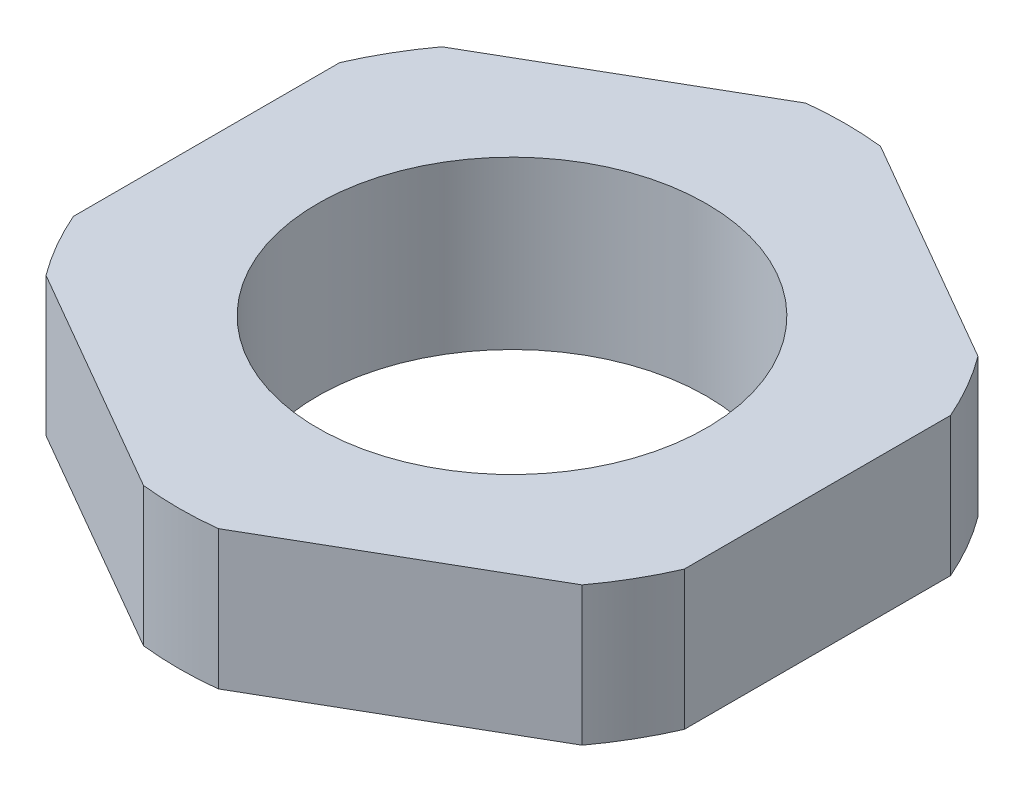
ISO-10303-21;
HEADER;
FILE_DESCRIPTION(('STEP AP214'),'2;1');
FILE_NAME('part.step','',(''),(''),'','','');
FILE_SCHEMA(('AUTOMOTIVE_DESIGN { 1 0 10303 214 1 1 1 1 }'));
ENDSEC;
DATA;
#1=APPLICATION_CONTEXT('core data for automotive mechanical design processes');
#2=APPLICATION_PROTOCOL_DEFINITION('international standard','automotive_design',2000,#1);
#3=PRODUCT_CONTEXT('',#1,'mechanical');
#4=PRODUCT('Part','Part','',(#3));
#5=PRODUCT_RELATED_PRODUCT_CATEGORY('part','',(#4));
#6=PRODUCT_DEFINITION_FORMATION('','',#4);
#7=PRODUCT_DEFINITION_CONTEXT('part definition',#1,'design');
#8=PRODUCT_DEFINITION('design','',#6,#7);
#9=PRODUCT_DEFINITION_SHAPE('','',#8);
#10=(LENGTH_UNIT() NAMED_UNIT(*) SI_UNIT(.MILLI.,.METRE.));
#11=(NAMED_UNIT(*) PLANE_ANGLE_UNIT() SI_UNIT($,.RADIAN.));
#12=(NAMED_UNIT(*) SI_UNIT($,.STERADIAN.) SOLID_ANGLE_UNIT());
#13=UNCERTAINTY_MEASURE_WITH_UNIT(LENGTH_MEASURE(1.E-05),#10,'distance_accuracy_value','');
#14=(GEOMETRIC_REPRESENTATION_CONTEXT(3) GLOBAL_UNCERTAINTY_ASSIGNED_CONTEXT((#13)) GLOBAL_UNIT_ASSIGNED_CONTEXT((#10,
#11,#12)) REPRESENTATION_CONTEXT('',''));
#15=CARTESIAN_POINT('',(0.,0.,0.));
#16=DIRECTION('',(0.,0.,1.));
#17=DIRECTION('',(1.,0.,0.));
#18=AXIS2_PLACEMENT_3D('',#15,#16,#17);
#19=CARTESIAN_POINT('',(0.,1.00000000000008,0.));
#20=DIRECTION('',(0.,1.,0.));
#21=DIRECTION('',(0.,0.,1.));
#22=AXIS2_PLACEMENT_3D('',#19,#20,#21);
#23=CONICAL_SURFACE('',#22,10.4999999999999,0.7853981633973);
#24=CARTESIAN_POINT('',(0.,0.,0.));
#25=DIRECTION('',(0.,1.,0.));
#26=DIRECTION('',(0.,0.,1.));
#27=AXIS2_PLACEMENT_3D('',#24,#25,#26);
#28=CIRCLE('',#27,9.50000000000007);
#29=CARTESIAN_POINT('',(0.,0.,9.50000000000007));
#30=VERTEX_POINT('',#29);
#31=EDGE_CURVE('P0_E122',#30,#30,#28,.F.);
#32=ORIENTED_EDGE('',*,*,#31,.F.);
#33=EDGE_LOOP('',(#32));
#34=FACE_BOUND('',#33,.T.);
#35=CARTESIAN_POINT('',(0.,1.00000000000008,0.));
#36=DIRECTION('',(0.,1.,0.));
#37=DIRECTION('',(0.,0.,1.));
#38=AXIS2_PLACEMENT_3D('',#35,#36,#37);
#39=CIRCLE('',#38,10.4999999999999);
#40=CARTESIAN_POINT('',(0.,1.00000000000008,10.4999999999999));
#41=VERTEX_POINT('',#40);
#42=EDGE_CURVE('P0_E19',#41,#41,#39,.T.);
#43=ORIENTED_EDGE('',*,*,#42,.F.);
#44=EDGE_LOOP('',(#43));
#45=FACE_BOUND('',#44,.T.);
#46=ADVANCED_FACE('P0_F16',(#34,#45),#23,.T.);
#47=CARTESIAN_POINT('',(0.,1.,0.));
#48=DIRECTION('',(0.,-1.,0.));
#49=DIRECTION('',(0.,0.,-1.));
#50=AXIS2_PLACEMENT_3D('',#47,#48,#49);
#51=PLANE('',#50);
#52=ORIENTED_EDGE('',*,*,#42,.T.);
#53=EDGE_LOOP('',(#52));
#54=FACE_BOUND('',#53,.T.);
#55=CARTESIAN_POINT('',(0.,1.,0.));
#56=DIRECTION('',(0.,-1.,0.));
#57=DIRECTION('',(0.,0.,-1.));
#58=AXIS2_PLACEMENT_3D('',#55,#56,#57);
#59=CIRCLE('',#58,12.);
#60=CARTESIAN_POINT('',(1.34668806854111,1.,-11.9241952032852));
#61=VERTEX_POINT('',#60);
#62=CARTESIAN_POINT('',(-1.34668806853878,1.,-11.9241952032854));
#63=VERTEX_POINT('',#62);
#64=EDGE_CURVE('P0_E118',#61,#63,#59,.F.);
#65=ORIENTED_EDGE('',*,*,#64,.F.);
#66=DIRECTION('',(0.866025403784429,0.,0.500000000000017));
#67=VECTOR('',#66,1.);
#68=CARTESIAN_POINT('',(11.,1.,-6.350852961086));
#69=LINE('',#68,#67);
#70=CARTESIAN_POINT('',(9.65331193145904,1.,-7.12836367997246));
#71=VERTEX_POINT('',#70);
#72=EDGE_CURVE('P0_E113',#61,#71,#69,.T.);
#73=ORIENTED_EDGE('',*,*,#72,.T.);
#74=CARTESIAN_POINT('',(0.,1.,0.));
#75=DIRECTION('',(0.,-1.,0.));
#76=DIRECTION('',(0.,0.,-1.));
#77=AXIS2_PLACEMENT_3D('',#74,#75,#76);
#78=CIRCLE('',#77,12.);
#79=CARTESIAN_POINT('',(11.,1.,-4.79583152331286));
#80=VERTEX_POINT('',#79);
#81=EDGE_CURVE('P0_E103',#80,#71,#78,.F.);
#82=ORIENTED_EDGE('',*,*,#81,.F.);
#83=DIRECTION('',(0.,0.,1.));
#84=VECTOR('',#83,1.);
#85=CARTESIAN_POINT('',(11.,1.,6.350852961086));
#86=LINE('',#85,#84);
#87=CARTESIAN_POINT('',(10.9999999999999,1.,4.79583152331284));
#88=VERTEX_POINT('',#87);
#89=EDGE_CURVE('P0_E128',#80,#88,#86,.T.);
#90=ORIENTED_EDGE('',*,*,#89,.T.);
#91=CARTESIAN_POINT('',(0.,1.,0.));
#92=DIRECTION('',(0.,-1.,0.));
#93=DIRECTION('',(0.,0.,-1.));
#94=AXIS2_PLACEMENT_3D('',#91,#92,#93);
#95=CIRCLE('',#94,12.);
#96=CARTESIAN_POINT('',(9.65331193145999,1.,7.1283636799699));
#97=VERTEX_POINT('',#96);
#98=EDGE_CURVE('P0_E150',#97,#88,#95,.F.);
#99=ORIENTED_EDGE('',*,*,#98,.F.);
#100=DIRECTION('',(-0.866025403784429,0.,0.500000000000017));
#101=VECTOR('',#100,1.);
#102=CARTESIAN_POINT('',(0.,1.,12.70170592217));
#103=LINE('',#102,#101);
#104=CARTESIAN_POINT('',(1.34668806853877,1.,11.9241952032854));
#105=VERTEX_POINT('',#104);
#106=EDGE_CURVE('P0_E145',#97,#105,#103,.T.);
#107=ORIENTED_EDGE('',*,*,#106,.T.);
#108=CARTESIAN_POINT('',(0.,1.,0.));
#109=DIRECTION('',(0.,-1.,0.));
#110=DIRECTION('',(0.,0.,-1.));
#111=AXIS2_PLACEMENT_3D('',#108,#109,#110);
#112=CIRCLE('',#111,12.);
#113=CARTESIAN_POINT('',(-1.34668806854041,1.,11.9241952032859));
#114=VERTEX_POINT('',#113);
#115=EDGE_CURVE('P0_E148',#114,#105,#112,.F.);
#116=ORIENTED_EDGE('',*,*,#115,.F.);
#117=DIRECTION('',(-0.866025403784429,0.,-0.500000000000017));
#118=VECTOR('',#117,1.);
#119=CARTESIAN_POINT('',(-11.,1.,6.350852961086));
#120=LINE('',#119,#118);
#121=CARTESIAN_POINT('',(-9.65331193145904,1.,7.12836367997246));
#122=VERTEX_POINT('',#121);
#123=EDGE_CURVE('P0_E140',#114,#122,#120,.T.);
#124=ORIENTED_EDGE('',*,*,#123,.T.);
#125=CARTESIAN_POINT('',(0.,1.,0.));
#126=DIRECTION('',(0.,-1.,0.));
#127=DIRECTION('',(0.,0.,-1.));
#128=AXIS2_PLACEMENT_3D('',#125,#126,#127);
#129=CIRCLE('',#128,12.);
#130=CARTESIAN_POINT('',(-11.,1.,4.79583152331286));
#131=VERTEX_POINT('',#130);
#132=EDGE_CURVE('P0_E143',#131,#122,#129,.F.);
#133=ORIENTED_EDGE('',*,*,#132,.F.);
#134=DIRECTION('',(0.,0.,-1.));
#135=VECTOR('',#134,1.);
#136=CARTESIAN_POINT('',(-11.,1.,-6.350852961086));
#137=LINE('',#136,#135);
#138=CARTESIAN_POINT('',(-10.9999999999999,1.,-4.79583152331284));
#139=VERTEX_POINT('',#138);
#140=EDGE_CURVE('P0_E135',#131,#139,#137,.T.);
#141=ORIENTED_EDGE('',*,*,#140,.T.);
#142=CARTESIAN_POINT('',(0.,1.,0.));
#143=DIRECTION('',(0.,-1.,0.));
#144=DIRECTION('',(0.,0.,-1.));
#145=AXIS2_PLACEMENT_3D('',#142,#143,#144);
#146=CIRCLE('',#145,12.);
#147=CARTESIAN_POINT('',(-9.65331193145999,1.,-7.1283636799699));
#148=VERTEX_POINT('',#147);
#149=EDGE_CURVE('P0_E138',#148,#139,#146,.F.);
#150=ORIENTED_EDGE('',*,*,#149,.F.);
#151=DIRECTION('',(0.866025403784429,0.,-0.500000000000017));
#152=VECTOR('',#151,1.);
#153=CARTESIAN_POINT('',(0.,1.,-12.70170592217));
#154=LINE('',#153,#152);
#155=EDGE_CURVE('P0_E132',#148,#63,#154,.T.);
#156=ORIENTED_EDGE('',*,*,#155,.T.);
#157=EDGE_LOOP('',(#65,#73,#82,#90,#99,#107,#116,#124,#133,#141,#150,#156));
#158=FACE_BOUND('',#157,.T.);
#159=ADVANCED_FACE('P0_F116',(#54,#158),#51,.T.);
#160=CARTESIAN_POINT('',(0.,0.,0.));
#161=DIRECTION('',(0.,-1.,0.));
#162=DIRECTION('',(0.,0.,-1.));
#163=AXIS2_PLACEMENT_3D('',#160,#161,#162);
#164=PLANE('',#163);
#165=CARTESIAN_POINT('',(0.,0.,0.));
#166=DIRECTION('',(0.,-1.,0.));
#167=DIRECTION('',(0.,0.,-1.));
#168=AXIS2_PLACEMENT_3D('',#165,#166,#167);
#169=CIRCLE('',#168,7.);
#170=CARTESIAN_POINT('',(0.,0.,-7.));
#171=VERTEX_POINT('',#170);
#172=EDGE_CURVE('P0_E172',#171,#171,#169,.F.);
#173=ORIENTED_EDGE('',*,*,#172,.T.);
#174=EDGE_LOOP('',(#173));
#175=FACE_BOUND('',#174,.T.);
#176=ORIENTED_EDGE('',*,*,#31,.T.);
#177=EDGE_LOOP('',(#176));
#178=FACE_BOUND('',#177,.T.);
#179=ADVANCED_FACE('P0_F197',(#175,#178),#164,.T.);
#180=CARTESIAN_POINT('',(11.,0.,-6.350852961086));
#181=DIRECTION('',(-0.500000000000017,0.,0.866025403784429));
#182=DIRECTION('',(0.866025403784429,0.,0.500000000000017));
#183=AXIS2_PLACEMENT_3D('',#180,#181,#182);
#184=PLANE('',#183);
#185=ORIENTED_EDGE('',*,*,#72,.F.);
#186=DIRECTION('',(0.,-1.,0.));
#187=VECTOR('',#186,1.);
#188=CARTESIAN_POINT('',(1.34668806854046,6.3,-11.9241952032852));
#189=LINE('',#188,#187);
#190=CARTESIAN_POINT('',(1.34668806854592,6.,-11.9241952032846));
#191=VERTEX_POINT('',#190);
#192=EDGE_CURVE('P0_E175',#191,#61,#189,.T.);
#193=ORIENTED_EDGE('',*,*,#192,.F.);
#194=DIRECTION('',(0.866025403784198,0.,0.500000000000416));
#195=VECTOR('',#194,1.);
#196=CARTESIAN_POINT('',(1.346688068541,6.,-11.92419520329));
#197=LINE('',#196,#195);
#198=CARTESIAN_POINT('',(9.65331193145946,6.,-7.1283636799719));
#199=VERTEX_POINT('',#198);
#200=EDGE_CURVE('P0_E126',#191,#199,#197,.T.);
#201=ORIENTED_EDGE('',*,*,#200,.T.);
#202=DIRECTION('',(0.,-1.,0.));
#203=VECTOR('',#202,1.);
#204=CARTESIAN_POINT('',(9.65331193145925,6.3,-7.12836367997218));
#205=LINE('',#204,#203);
#206=EDGE_CURVE('P0_E110',#71,#199,#205,.F.);
#207=ORIENTED_EDGE('',*,*,#206,.F.);
#208=EDGE_LOOP('',(#185,#193,#201,#207));
#209=FACE_BOUND('',#208,.T.);
#210=ADVANCED_FACE('P0_F125',(#209),#184,.F.);
#211=CARTESIAN_POINT('',(0.,6.3,0.));
#212=DIRECTION('',(0.,-1.,0.));
#213=DIRECTION('',(0.,0.,-1.));
#214=AXIS2_PLACEMENT_3D('',#211,#212,#213);
#215=CYLINDRICAL_SURFACE('',#214,12.);
#216=ORIENTED_EDGE('',*,*,#81,.T.);
#217=ORIENTED_EDGE('',*,*,#206,.T.);
#218=CARTESIAN_POINT('',(0.,6.,0.));
#219=DIRECTION('',(0.,-1.,0.));
#220=DIRECTION('',(0.,0.,-1.));
#221=AXIS2_PLACEMENT_3D('',#218,#219,#220);
#222=CIRCLE('',#221,12.);
#223=CARTESIAN_POINT('',(11.,6.,-4.79583152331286));
#224=VERTEX_POINT('',#223);
#225=EDGE_CURVE('P0_E170',#199,#224,#222,.T.);
#226=ORIENTED_EDGE('',*,*,#225,.T.);
#227=DIRECTION('',(0.,1.,0.));
#228=VECTOR('',#227,1.);
#229=CARTESIAN_POINT('',(11.,0.,-4.795831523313));
#230=LINE('',#229,#228);
#231=EDGE_CURVE('P0_E112',#224,#80,#230,.F.);
#232=ORIENTED_EDGE('',*,*,#231,.T.);
#233=EDGE_LOOP('',(#216,#217,#226,#232));
#234=FACE_BOUND('',#233,.T.);
#235=ADVANCED_FACE('P0_F107',(#234),#215,.T.);
#236=CARTESIAN_POINT('',(11.,0.,6.350852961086));
#237=DIRECTION('',(-1.,0.,0.));
#238=DIRECTION('',(0.,0.,1.));
#239=AXIS2_PLACEMENT_3D('',#236,#237,#238);
#240=PLANE('',#239);
#241=ORIENTED_EDGE('',*,*,#231,.F.);
#242=DIRECTION('',(0.,0.,-1.));
#243=VECTOR('',#242,1.);
#244=CARTESIAN_POINT('',(11.,6.,0.));
#245=LINE('',#244,#243);
#246=CARTESIAN_POINT('',(10.9999999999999,6.,4.79583152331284));
#247=VERTEX_POINT('',#246);
#248=EDGE_CURVE('P0_E169',#224,#247,#245,.F.);
#249=ORIENTED_EDGE('',*,*,#248,.T.);
#250=DIRECTION('',(0.,-1.,0.));
#251=VECTOR('',#250,1.);
#252=CARTESIAN_POINT('',(10.9999999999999,6.3,4.79583152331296));
#253=LINE('',#252,#251);
#254=EDGE_CURVE('P0_E183',#88,#247,#253,.F.);
#255=ORIENTED_EDGE('',*,*,#254,.F.);
#256=ORIENTED_EDGE('',*,*,#89,.F.);
#257=EDGE_LOOP('',(#241,#249,#255,#256));
#258=FACE_BOUND('',#257,.T.);
#259=ADVANCED_FACE('P0_F245',(#258),#240,.F.);
#260=CARTESIAN_POINT('',(0.,6.3,0.));
#261=DIRECTION('',(0.,-1.,0.));
#262=DIRECTION('',(0.,0.,-1.));
#263=AXIS2_PLACEMENT_3D('',#260,#261,#262);
#264=CYLINDRICAL_SURFACE('',#263,12.);
#265=CARTESIAN_POINT('',(0.,6.,0.));
#266=DIRECTION('',(0.,-1.,0.));
#267=DIRECTION('',(0.,0.,-1.));
#268=AXIS2_PLACEMENT_3D('',#265,#266,#267);
#269=CIRCLE('',#268,12.);
#270=CARTESIAN_POINT('',(9.653311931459,6.,7.12836367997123));
#271=VERTEX_POINT('',#270);
#272=EDGE_CURVE('P0_E166',#247,#271,#269,.T.);
#273=ORIENTED_EDGE('',*,*,#272,.T.);
#274=DIRECTION('',(0.,1.,0.));
#275=VECTOR('',#274,1.);
#276=CARTESIAN_POINT('',(9.65331193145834,0.,7.12836367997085));
#277=LINE('',#276,#275);
#278=EDGE_CURVE('P0_E149',#271,#97,#277,.F.);
#279=ORIENTED_EDGE('',*,*,#278,.T.);
#280=ORIENTED_EDGE('',*,*,#98,.T.);
#281=ORIENTED_EDGE('',*,*,#254,.T.);
#282=EDGE_LOOP('',(#273,#279,#280,#281));
#283=FACE_BOUND('',#282,.T.);
#284=ADVANCED_FACE('P0_F241',(#283),#264,.T.);
#285=CARTESIAN_POINT('',(0.,0.,12.70170592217));
#286=DIRECTION('',(-0.500000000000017,0.,-0.866025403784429));
#287=DIRECTION('',(-0.866025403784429,0.,0.500000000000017));
#288=AXIS2_PLACEMENT_3D('',#285,#286,#287);
#289=PLANE('',#288);
#290=DIRECTION('',(0.,-1.,0.));
#291=VECTOR('',#290,1.);
#292=CARTESIAN_POINT('',(1.34668806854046,6.3,11.9241952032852));
#293=LINE('',#292,#291);
#294=CARTESIAN_POINT('',(1.34668806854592,6.,11.9241952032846));
#295=VERTEX_POINT('',#294);
#296=EDGE_CURVE('P0_E182',#105,#295,#293,.F.);
#297=ORIENTED_EDGE('',*,*,#296,.F.);
#298=ORIENTED_EDGE('',*,*,#106,.F.);
#299=ORIENTED_EDGE('',*,*,#278,.F.);
#300=DIRECTION('',(-0.866025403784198,0.,0.500000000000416));
#301=VECTOR('',#300,1.);
#302=CARTESIAN_POINT('',(9.653311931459,6.,7.128363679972));
#303=LINE('',#302,#301);
#304=EDGE_CURVE('P0_E165',#271,#295,#303,.T.);
#305=ORIENTED_EDGE('',*,*,#304,.T.);
#306=EDGE_LOOP('',(#297,#298,#299,#305));
#307=FACE_BOUND('',#306,.T.);
#308=ADVANCED_FACE('P0_F237',(#307),#289,.F.);
#309=CARTESIAN_POINT('',(0.,6.3,0.));
#310=DIRECTION('',(0.,-1.,0.));
#311=DIRECTION('',(0.,0.,-1.));
#312=AXIS2_PLACEMENT_3D('',#309,#310,#311);
#313=CYLINDRICAL_SURFACE('',#312,12.);
#314=CARTESIAN_POINT('',(0.,6.,0.));
#315=DIRECTION('',(0.,-1.,0.));
#316=DIRECTION('',(0.,0.,-1.));
#317=AXIS2_PLACEMENT_3D('',#314,#315,#316);
#318=CIRCLE('',#317,12.);
#319=CARTESIAN_POINT('',(-1.34668806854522,6.,11.9241952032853));
#320=VERTEX_POINT('',#319);
#321=EDGE_CURVE('P0_E162',#295,#320,#318,.T.);
#322=ORIENTED_EDGE('',*,*,#321,.T.);
#323=DIRECTION('',(0.,1.,0.));
#324=VECTOR('',#323,1.);
#325=CARTESIAN_POINT('',(-1.34668806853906,0.,11.9241952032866));
#326=LINE('',#325,#324);
#327=EDGE_CURVE('P0_E144',#320,#114,#326,.F.);
#328=ORIENTED_EDGE('',*,*,#327,.T.);
#329=ORIENTED_EDGE('',*,*,#115,.T.);
#330=ORIENTED_EDGE('',*,*,#296,.T.);
#331=EDGE_LOOP('',(#322,#328,#329,#330));
#332=FACE_BOUND('',#331,.T.);
#333=ADVANCED_FACE('P0_F233',(#332),#313,.T.);
#334=CARTESIAN_POINT('',(-11.,0.,6.350852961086));
#335=DIRECTION('',(0.500000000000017,0.,-0.866025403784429));
#336=DIRECTION('',(-0.866025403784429,0.,-0.500000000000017));
#337=AXIS2_PLACEMENT_3D('',#334,#335,#336);
#338=PLANE('',#337);
#339=DIRECTION('',(0.,-1.,0.));
#340=VECTOR('',#339,1.);
#341=CARTESIAN_POINT('',(-9.65331193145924,6.3,7.12836367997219));
#342=LINE('',#341,#340);
#343=CARTESIAN_POINT('',(-9.65331193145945,6.,7.1283636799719));
#344=VERTEX_POINT('',#343);
#345=EDGE_CURVE('P0_E180',#122,#344,#342,.F.);
#346=ORIENTED_EDGE('',*,*,#345,.F.);
#347=ORIENTED_EDGE('',*,*,#123,.F.);
#348=ORIENTED_EDGE('',*,*,#327,.F.);
#349=DIRECTION('',(-0.866025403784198,0.,-0.500000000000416));
#350=VECTOR('',#349,1.);
#351=CARTESIAN_POINT('',(-1.346688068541,6.,11.92419520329));
#352=LINE('',#351,#350);
#353=EDGE_CURVE('P0_E161',#320,#344,#352,.T.);
#354=ORIENTED_EDGE('',*,*,#353,.T.);
#355=EDGE_LOOP('',(#346,#347,#348,#354));
#356=FACE_BOUND('',#355,.T.);
#357=ADVANCED_FACE('P0_F229',(#356),#338,.F.);
#358=CARTESIAN_POINT('',(0.,6.3,0.));
#359=DIRECTION('',(0.,-1.,0.));
#360=DIRECTION('',(0.,0.,-1.));
#361=AXIS2_PLACEMENT_3D('',#358,#359,#360);
#362=CYLINDRICAL_SURFACE('',#361,12.);
#363=CARTESIAN_POINT('',(0.,6.,0.));
#364=DIRECTION('',(0.,-1.,0.));
#365=DIRECTION('',(0.,0.,-1.));
#366=AXIS2_PLACEMENT_3D('',#363,#364,#365);
#367=CIRCLE('',#366,12.);
#368=CARTESIAN_POINT('',(-11.,6.,4.79583152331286));
#369=VERTEX_POINT('',#368);
#370=EDGE_CURVE('P0_E158',#344,#369,#367,.T.);
#371=ORIENTED_EDGE('',*,*,#370,.T.);
#372=DIRECTION('',(0.,1.,0.));
#373=VECTOR('',#372,1.);
#374=CARTESIAN_POINT('',(-11.,0.,4.795831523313));
#375=LINE('',#374,#373);
#376=EDGE_CURVE('P0_E139',#369,#131,#375,.F.);
#377=ORIENTED_EDGE('',*,*,#376,.T.);
#378=ORIENTED_EDGE('',*,*,#132,.T.);
#379=ORIENTED_EDGE('',*,*,#345,.T.);
#380=EDGE_LOOP('',(#371,#377,#378,#379));
#381=FACE_BOUND('',#380,.T.);
#382=ADVANCED_FACE('P0_F225',(#381),#362,.T.);
#383=CARTESIAN_POINT('',(-11.,0.,-6.350852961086));
#384=DIRECTION('',(1.,0.,0.));
#385=DIRECTION('',(0.,0.,-1.));
#386=AXIS2_PLACEMENT_3D('',#383,#384,#385);
#387=PLANE('',#386);
#388=DIRECTION('',(0.,-1.,0.));
#389=VECTOR('',#388,1.);
#390=CARTESIAN_POINT('',(-10.9999999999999,6.3,-4.79583152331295));
#391=LINE('',#390,#389);
#392=CARTESIAN_POINT('',(-10.9999999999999,6.,-4.79583152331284));
#393=VERTEX_POINT('',#392);
#394=EDGE_CURVE('P0_E178',#139,#393,#391,.F.);
#395=ORIENTED_EDGE('',*,*,#394,.F.);
#396=ORIENTED_EDGE('',*,*,#140,.F.);
#397=ORIENTED_EDGE('',*,*,#376,.F.);
#398=DIRECTION('',(0.,0.,-1.));
#399=VECTOR('',#398,1.);
#400=CARTESIAN_POINT('',(-11.,6.,0.));
#401=LINE('',#400,#399);
#402=EDGE_CURVE('P0_E157',#369,#393,#401,.T.);
#403=ORIENTED_EDGE('',*,*,#402,.T.);
#404=EDGE_LOOP('',(#395,#396,#397,#403));
#405=FACE_BOUND('',#404,.T.);
#406=ADVANCED_FACE('P0_F221',(#405),#387,.F.);
#407=CARTESIAN_POINT('',(0.,6.3,0.));
#408=DIRECTION('',(0.,-1.,0.));
#409=DIRECTION('',(0.,0.,-1.));
#410=AXIS2_PLACEMENT_3D('',#407,#408,#409);
#411=CYLINDRICAL_SURFACE('',#410,12.);
#412=CARTESIAN_POINT('',(0.,6.,0.));
#413=DIRECTION('',(0.,-1.,0.));
#414=DIRECTION('',(0.,0.,-1.));
#415=AXIS2_PLACEMENT_3D('',#412,#413,#414);
#416=CIRCLE('',#415,12.);
#417=CARTESIAN_POINT('',(-9.653311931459,6.,-7.12836367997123));
#418=VERTEX_POINT('',#417);
#419=EDGE_CURVE('P0_E154',#393,#418,#416,.T.);
#420=ORIENTED_EDGE('',*,*,#419,.T.);
#421=DIRECTION('',(0.,1.,0.));
#422=VECTOR('',#421,1.);
#423=CARTESIAN_POINT('',(-9.65331193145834,0.,-7.12836367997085));
#424=LINE('',#423,#422);
#425=EDGE_CURVE('P0_E134',#418,#148,#424,.F.);
#426=ORIENTED_EDGE('',*,*,#425,.T.);
#427=ORIENTED_EDGE('',*,*,#149,.T.);
#428=ORIENTED_EDGE('',*,*,#394,.T.);
#429=EDGE_LOOP('',(#420,#426,#427,#428));
#430=FACE_BOUND('',#429,.T.);
#431=ADVANCED_FACE('P0_F217',(#430),#411,.T.);
#432=CARTESIAN_POINT('',(0.,0.,-12.70170592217));
#433=DIRECTION('',(0.500000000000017,0.,0.866025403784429));
#434=DIRECTION('',(0.866025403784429,0.,-0.500000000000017));
#435=AXIS2_PLACEMENT_3D('',#432,#433,#434);
#436=PLANE('',#435);
#437=ORIENTED_EDGE('',*,*,#155,.F.);
#438=ORIENTED_EDGE('',*,*,#425,.F.);
#439=DIRECTION('',(0.866025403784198,0.,-0.500000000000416));
#440=VECTOR('',#439,1.);
#441=CARTESIAN_POINT('',(-9.653311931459,6.,-7.128363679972));
#442=LINE('',#441,#440);
#443=CARTESIAN_POINT('',(-1.34668806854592,6.,-11.9241952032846));
#444=VERTEX_POINT('',#443);
#445=EDGE_CURVE('P0_E153',#418,#444,#442,.T.);
#446=ORIENTED_EDGE('',*,*,#445,.T.);
#447=DIRECTION('',(0.,-1.,0.));
#448=VECTOR('',#447,1.);
#449=CARTESIAN_POINT('',(-1.34668806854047,6.3,-11.9241952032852));
#450=LINE('',#449,#448);
#451=EDGE_CURVE('P0_E34',#63,#444,#450,.F.);
#452=ORIENTED_EDGE('',*,*,#451,.F.);
#453=EDGE_LOOP('',(#437,#438,#446,#452));
#454=FACE_BOUND('',#453,.T.);
#455=ADVANCED_FACE('P0_F214',(#454),#436,.F.);
#456=CARTESIAN_POINT('',(0.,6.3,0.));
#457=DIRECTION('',(0.,-1.,0.));
#458=DIRECTION('',(0.,0.,-1.));
#459=AXIS2_PLACEMENT_3D('',#456,#457,#458);
#460=CYLINDRICAL_SURFACE('',#459,12.);
#461=CARTESIAN_POINT('',(0.,6.,0.));
#462=DIRECTION('',(0.,-1.,0.));
#463=DIRECTION('',(0.,0.,-1.));
#464=AXIS2_PLACEMENT_3D('',#461,#462,#463);
#465=CIRCLE('',#464,12.);
#466=EDGE_CURVE('P0_E25',#444,#191,#465,.T.);
#467=ORIENTED_EDGE('',*,*,#466,.T.);
#468=ORIENTED_EDGE('',*,*,#192,.T.);
#469=ORIENTED_EDGE('',*,*,#64,.T.);
#470=ORIENTED_EDGE('',*,*,#451,.T.);
#471=EDGE_LOOP('',(#467,#468,#469,#470));
#472=FACE_BOUND('',#471,.T.);
#473=ADVANCED_FACE('P0_F206',(#472),#460,.T.);
#474=CARTESIAN_POINT('',(0.,6.3,0.));
#475=DIRECTION('',(0.,-1.,0.));
#476=DIRECTION('',(0.,0.,-1.));
#477=AXIS2_PLACEMENT_3D('',#474,#475,#476);
#478=CYLINDRICAL_SURFACE('',#477,7.);
#479=ORIENTED_EDGE('',*,*,#172,.F.);
#480=EDGE_LOOP('',(#479));
#481=FACE_BOUND('',#480,.T.);
#482=CARTESIAN_POINT('',(0.,6.,0.));
#483=DIRECTION('',(0.,-1.,0.));
#484=DIRECTION('',(0.,0.,-1.));
#485=AXIS2_PLACEMENT_3D('',#482,#483,#484);
#486=CIRCLE('',#485,7.);
#487=CARTESIAN_POINT('',(0.,6.,-7.));
#488=VERTEX_POINT('',#487);
#489=EDGE_CURVE('P0_E11',#488,#488,#486,.F.);
#490=ORIENTED_EDGE('',*,*,#489,.T.);
#491=EDGE_LOOP('',(#490));
#492=FACE_BOUND('',#491,.T.);
#493=ADVANCED_FACE('P0_F200',(#481,#492),#478,.F.);
#494=CARTESIAN_POINT('',(0.,6.,0.));
#495=DIRECTION('',(0.,-1.,0.));
#496=DIRECTION('',(0.,0.,-1.));
#497=AXIS2_PLACEMENT_3D('',#494,#495,#496);
#498=PLANE('',#497);
#499=ORIENTED_EDGE('',*,*,#489,.F.);
#500=EDGE_LOOP('',(#499));
#501=FACE_BOUND('',#500,.T.);
#502=ORIENTED_EDGE('',*,*,#445,.F.);
#503=ORIENTED_EDGE('',*,*,#419,.F.);
#504=ORIENTED_EDGE('',*,*,#402,.F.);
#505=ORIENTED_EDGE('',*,*,#370,.F.);
#506=ORIENTED_EDGE('',*,*,#353,.F.);
#507=ORIENTED_EDGE('',*,*,#321,.F.);
#508=ORIENTED_EDGE('',*,*,#304,.F.);
#509=ORIENTED_EDGE('',*,*,#272,.F.);
#510=ORIENTED_EDGE('',*,*,#248,.F.);
#511=ORIENTED_EDGE('',*,*,#225,.F.);
#512=ORIENTED_EDGE('',*,*,#200,.F.);
#513=ORIENTED_EDGE('',*,*,#466,.F.);
#514=EDGE_LOOP('',(#502,#503,#504,#505,#506,#507,#508,#509,#510,#511,#512,#513));
#515=FACE_BOUND('',#514,.T.);
#516=ADVANCED_FACE('P0_F198',(#501,#515),#498,.F.);
#517=CLOSED_SHELL('',(#46,#159,#179,#210,#235,#259,#284,#308,#333,#357,#382,#406,#431,#455,#473,
#493,#516));
#518=MANIFOLD_SOLID_BREP('P0_B1',#517);
#519=CARTESIAN_POINT('',(0.,0.,0.));
#520=DIRECTION('',(0.,1.,0.));
#521=DIRECTION('',(0.,0.,1.));
#522=AXIS2_PLACEMENT_3D('',#519,#520,#521);
#523=CYLINDRICAL_SURFACE('',#522,7.5);
#524=CARTESIAN_POINT('',(0.,6.,0.));
#525=DIRECTION('',(0.,1.,0.));
#526=DIRECTION('',(0.,0.,1.));
#527=AXIS2_PLACEMENT_3D('',#524,#525,#526);
#528=CIRCLE('',#527,7.5);
#529=CARTESIAN_POINT('',(0.,6.,7.5));
#530=VERTEX_POINT('',#529);
#531=EDGE_CURVE('P1_E15',#530,#530,#528,.F.);
#532=ORIENTED_EDGE('',*,*,#531,.T.);
#533=EDGE_LOOP('',(#532));
#534=FACE_BOUND('',#533,.T.);
#535=CARTESIAN_POINT('',(0.,0.,0.));
#536=DIRECTION('',(0.,1.,0.));
#537=DIRECTION('',(0.,0.,1.));
#538=AXIS2_PLACEMENT_3D('',#535,#536,#537);
#539=CIRCLE('',#538,7.5);
#540=CARTESIAN_POINT('',(0.,0.,7.5));
#541=VERTEX_POINT('',#540);
#542=EDGE_CURVE('P1_E10',#541,#541,#539,.T.);
#543=ORIENTED_EDGE('',*,*,#542,.T.);
#544=EDGE_LOOP('',(#543));
#545=FACE_BOUND('',#544,.T.);
#546=ADVANCED_FACE('P1_F14',(#534,#545),#523,.T.);
#547=OPEN_SHELL('',(#546));
#548=SHELL_BASED_SURFACE_MODEL('P1_B1',(#547));
#549=ADVANCED_BREP_SHAPE_REPRESENTATION('',(#18,#518),#14);
#550=MANIFOLD_SURFACE_SHAPE_REPRESENTATION('',(#18,#548),#14);
#551=SHAPE_REPRESENTATION('',(#18),#14);
#552=SHAPE_DEFINITION_REPRESENTATION(#9,#551);
#553=SHAPE_REPRESENTATION_RELATIONSHIP('','',#551,#549);
#554=SHAPE_REPRESENTATION_RELATIONSHIP('','',#551,#550);
ENDSEC;
END-ISO-10303-21;
